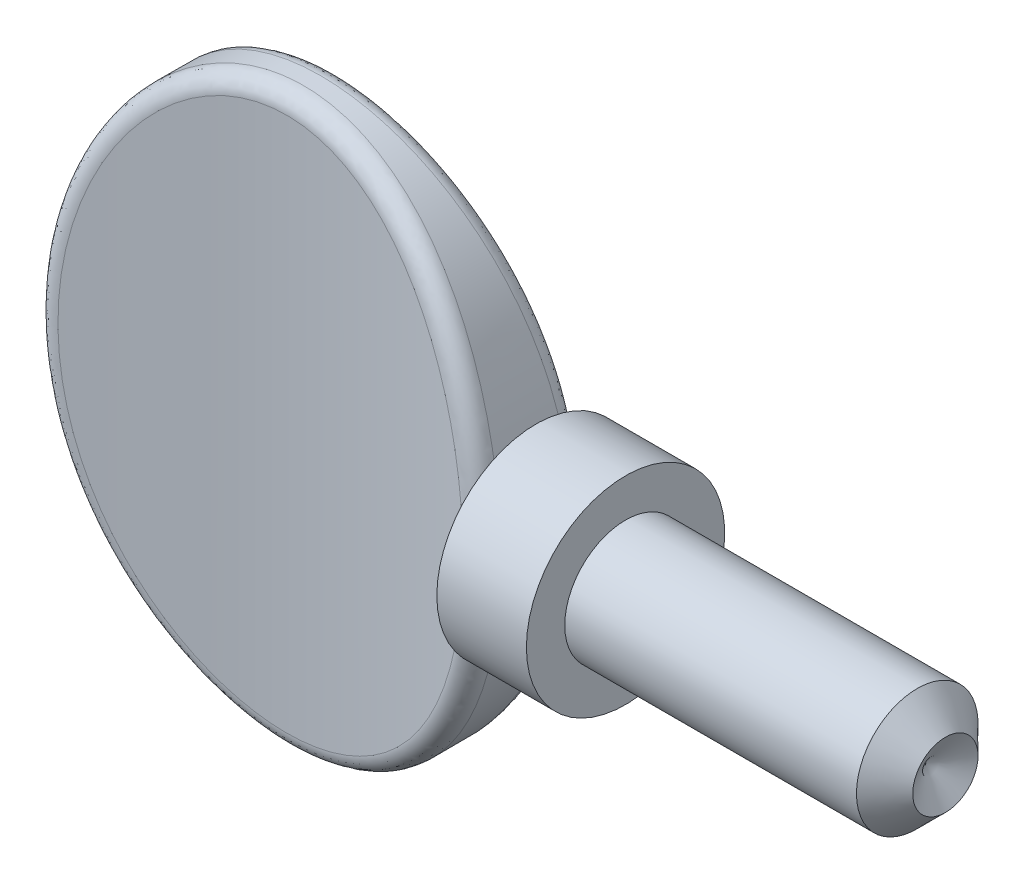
from build123d import *

# Parameters (mm, degrees)
SKETCH1_RX              = 11.303
SKETCH1_RY              = 8.889999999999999
EXTRUDE1_DEPTH          = 2.286
CUT_EXTRUDE1_DEPTH      = 15.560759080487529
CUT_EXTRUDE1_DEPTH_BACK = 15.560759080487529
SKETCH2_OUTSIDE_W       = 25.603999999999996
SKETCH2_OUTSIDE_H       = 12.396
FILLET3_R               = 0.6773333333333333


with BuildPart() as part:
    # Sketch1 → Extrude1 (new, symmetric)
    with BuildSketch(Plane.XY):
        with Locations(Location((0, 0), (0, 0, 90))):
            Ellipse(SKETCH1_RX, SKETCH1_RY)
    extrude(amount=EXTRUDE1_DEPTH, both=True)

    # Sketch2 outside → Cut-Extrude1 (cut, two sides: drawn at the far end of the back side and taken through both)
    with BuildSketch(Plane(origin=(0, 0, 0), x_dir=(1, 0, 0), z_dir=(0, 1, 0)).offset(-CUT_EXTRUDE1_DEPTH_BACK)):
        Rectangle(SKETCH2_OUTSIDE_W, SKETCH2_OUTSIDE_H)
        with BuildLine():
            Line((-8.889999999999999, 2.286), (-8.889999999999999, -2.286))
            ThreePointArc((-8.889999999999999, -2.286), (1.94e-15, -1.0159999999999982), (8.889999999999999, -2.286))
            Line((8.889999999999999, -2.286), (8.889999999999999, 2.286))
            ThreePointArc((8.889999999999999, 2.286), (1.94e-15, 1.0159999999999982), (-8.889999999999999, 2.286))
        make_face(mode=Mode.SUBTRACT)
    extrude(amount=CUT_EXTRUDE1_DEPTH + CUT_EXTRUDE1_DEPTH_BACK, mode=Mode.SUBTRACT)

    # Fillet3
    fillet3_edges = [part.edges().sort_by_distance(p)[0] for p in [
        (-6.499256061e-08, -11.302999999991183, 1.0159999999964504),
        (8.835220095e-08, -11.302999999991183, -1.0159999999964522),
    ]]
    fillet(fillet3_edges, radius=FILLET3_R)

    # Sketch3 → Revolve1 (revolve)
    with BuildSketch(Plane(origin=(0, 0, 0), x_dir=(1, 0, 0), z_dir=(0, 1, 0)), mode=Mode.PRIVATE) as revolve1_sk:
        with BuildLine():
            Line((12.445999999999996, 3.9369999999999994), (12.445999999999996, 2.413))
            Line((12.445999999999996, 2.413), (24.028399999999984, 2.413))
            Line((24.028399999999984, 2.413), (25.14599999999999, 1.2953999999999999))
            Line((25.14599999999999, 1.2953999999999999), (24.367645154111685, 0))
            Line((24.367645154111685, 0), (7.236423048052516, 0))
            Line((7.236423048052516, 0), (7.236423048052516, 1.8516557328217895))
            ThreePointArc((7.236423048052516, 1.8516557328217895), (8.426438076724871, 2.6063068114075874), (8.889999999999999, 3.9370000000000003))
            Line((8.889999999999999, 3.9370000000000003), (12.445999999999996, 3.9369999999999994))
        make_face()
    revolve(revolve1_sk.sketch.rotate(Axis((0, 0, 0), (1, 0, 0)), 180), axis=Axis((0, 0, 0), (1, 0, 0)))


solid = part.part
